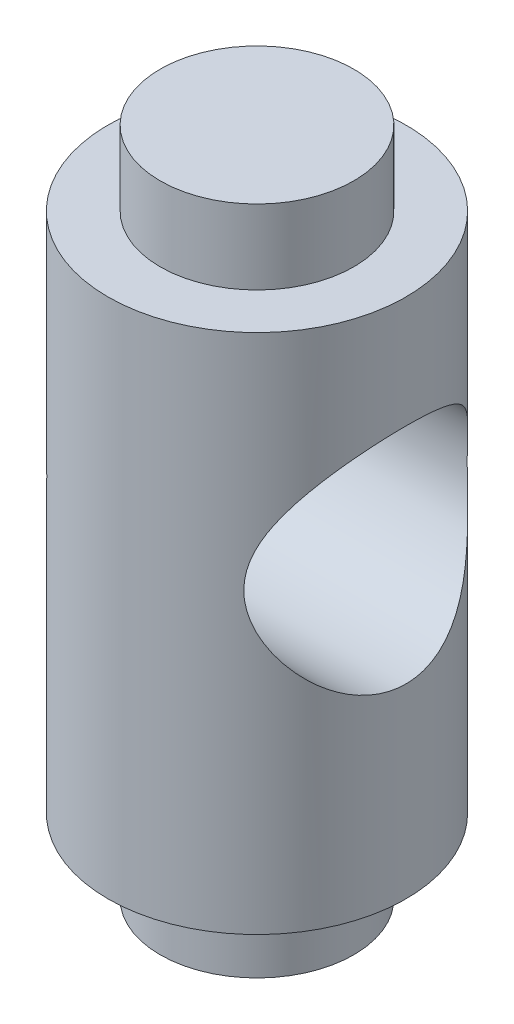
from build123d import *

# Parameters (mm, degrees)
CUT_EXTRUDE1_DEPTH      = 27.575364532
CUT_EXTRUDE1_DEPTH_BACK = 27.575364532
SKETCH2_R               = 7.5


with BuildPart() as part:
    # Sketch1 → Revolve1 (revolve)
    with BuildSketch(Plane.XY, mode=Mode.PRIVATE) as revolve1_sk:
        Polygon((0, 22.5), (0, -22.5), (-6.5, -22.5), (-6.5, -17.5), (-10, -17.5), (-10, 17.5), (-6.5, 17.5), (-6.5, 22.5), align=None)
    revolve(revolve1_sk.sketch.rotate(Axis((0, 22.5, 0), (0, -1, 0)), 270), axis=Axis((0, 22.5, 0), (0, -1, 0)))

    # Sketch2 → Cut-Extrude1 (cut, two sides: drawn at the far end of the back side and taken through both)
    with BuildSketch(Plane(origin=(0, 0, 0), x_dir=(0, 0, -1), z_dir=(1, 0, 0)).offset(-CUT_EXTRUDE1_DEPTH_BACK)):
        with Locations(Location((0, 2.5, 0), (0, 0, 180))):
            Circle(SKETCH2_R)
    extrude(amount=CUT_EXTRUDE1_DEPTH + CUT_EXTRUDE1_DEPTH_BACK, mode=Mode.SUBTRACT)


solid = part.part
